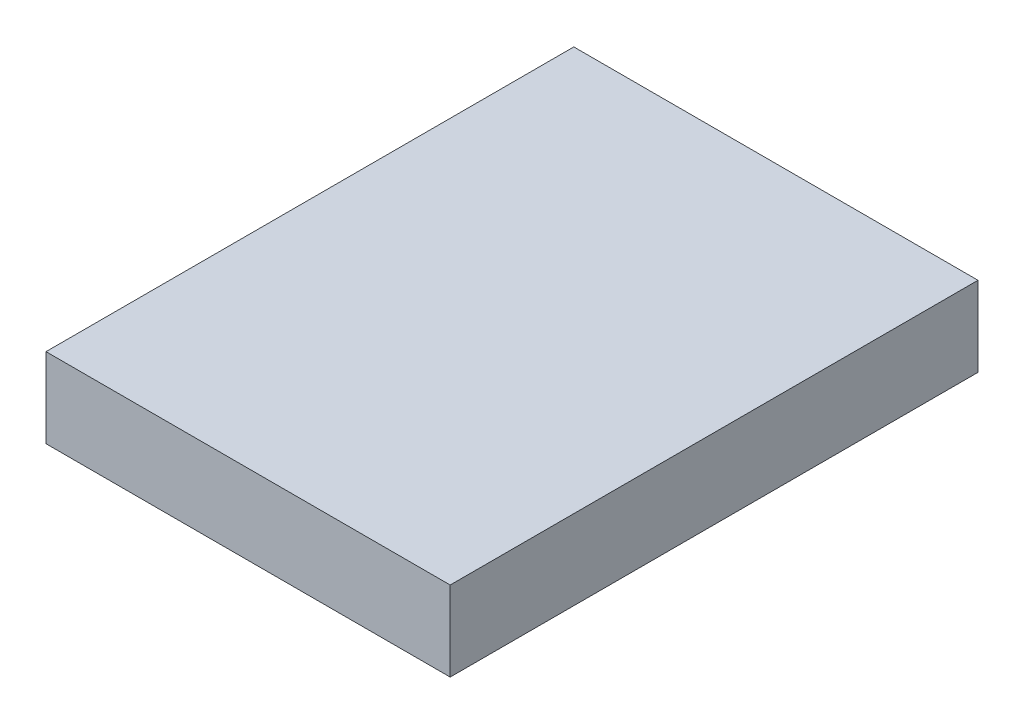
ISO-10303-21;
HEADER;
FILE_DESCRIPTION(('STEP AP214'),'2;1');
FILE_NAME('part.step','',(''),(''),'','','');
FILE_SCHEMA(('AUTOMOTIVE_DESIGN { 1 0 10303 214 1 1 1 1 }'));
ENDSEC;
DATA;
#1=APPLICATION_CONTEXT('core data for automotive mechanical design processes');
#2=APPLICATION_PROTOCOL_DEFINITION('international standard','automotive_design',2000,#1);
#3=PRODUCT_CONTEXT('',#1,'mechanical');
#4=PRODUCT('Part','Part','',(#3));
#5=PRODUCT_RELATED_PRODUCT_CATEGORY('part','',(#4));
#6=PRODUCT_DEFINITION_FORMATION('','',#4);
#7=PRODUCT_DEFINITION_CONTEXT('part definition',#1,'design');
#8=PRODUCT_DEFINITION('design','',#6,#7);
#9=PRODUCT_DEFINITION_SHAPE('','',#8);
#10=(LENGTH_UNIT() NAMED_UNIT(*) SI_UNIT(.MILLI.,.METRE.));
#11=(NAMED_UNIT(*) PLANE_ANGLE_UNIT() SI_UNIT($,.RADIAN.));
#12=(NAMED_UNIT(*) SI_UNIT($,.STERADIAN.) SOLID_ANGLE_UNIT());
#13=UNCERTAINTY_MEASURE_WITH_UNIT(LENGTH_MEASURE(1.E-05),#10,'distance_accuracy_value','');
#14=(GEOMETRIC_REPRESENTATION_CONTEXT(3) GLOBAL_UNCERTAINTY_ASSIGNED_CONTEXT((#13)) GLOBAL_UNIT_ASSIGNED_CONTEXT((#10,
#11,#12)) REPRESENTATION_CONTEXT('',''));
#15=CARTESIAN_POINT('',(0.,0.,0.));
#16=DIRECTION('',(0.,0.,1.));
#17=DIRECTION('',(1.,0.,0.));
#18=AXIS2_PLACEMENT_3D('',#15,#16,#17);
#19=CARTESIAN_POINT('',(-50.6824454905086,20.,66.1847496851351));
#20=DIRECTION('',(1.,0.,0.));
#21=DIRECTION('',(0.,0.,-1.));
#22=AXIS2_PLACEMENT_3D('',#19,#20,#21);
#23=PLANE('',#22);
#24=DIRECTION('',(0.,0.,1.));
#25=VECTOR('',#24,1.);
#26=CARTESIAN_POINT('',(-50.6824454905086,0.,66.1847496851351));
#27=LINE('',#26,#25);
#28=CARTESIAN_POINT('',(-50.6824454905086,0.,-66.1847496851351));
#29=VERTEX_POINT('',#28);
#30=CARTESIAN_POINT('',(-50.6824454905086,0.,66.1847496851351));
#31=VERTEX_POINT('',#30);
#32=EDGE_CURVE('E76',#29,#31,#27,.T.);
#33=ORIENTED_EDGE('',*,*,#32,.T.);
#34=DIRECTION('',(0.,-1.,0.));
#35=VECTOR('',#34,1.);
#36=CARTESIAN_POINT('',(-50.6824454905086,20.,66.1847496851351));
#37=LINE('',#36,#35);
#38=CARTESIAN_POINT('',(-50.6824454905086,20.,66.1847496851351));
#39=VERTEX_POINT('',#38);
#40=EDGE_CURVE('E11',#39,#31,#37,.T.);
#41=ORIENTED_EDGE('',*,*,#40,.F.);
#42=DIRECTION('',(0.,0.,1.));
#43=VECTOR('',#42,1.);
#44=CARTESIAN_POINT('',(-50.6824454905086,20.,66.1847496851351));
#45=LINE('',#44,#43);
#46=CARTESIAN_POINT('',(-50.6824454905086,20.,-66.1847496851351));
#47=VERTEX_POINT('',#46);
#48=EDGE_CURVE('E94',#47,#39,#45,.T.);
#49=ORIENTED_EDGE('',*,*,#48,.F.);
#50=DIRECTION('',(0.,-1.,0.));
#51=VECTOR('',#50,1.);
#52=CARTESIAN_POINT('',(-50.6824454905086,20.,-66.1847496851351));
#53=LINE('',#52,#51);
#54=EDGE_CURVE('E88',#47,#29,#53,.T.);
#55=ORIENTED_EDGE('',*,*,#54,.T.);
#56=EDGE_LOOP('',(#33,#41,#49,#55));
#57=FACE_BOUND('',#56,.T.);
#58=ADVANCED_FACE('F32',(#57),#23,.F.);
#59=CARTESIAN_POINT('',(-50.6824454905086,20.,66.1847496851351));
#60=DIRECTION('',(0.,0.,-1.));
#61=DIRECTION('',(-1.,0.,0.));
#62=AXIS2_PLACEMENT_3D('',#59,#60,#61);
#63=PLANE('',#62);
#64=DIRECTION('',(1.,0.,0.));
#65=VECTOR('',#64,1.);
#66=CARTESIAN_POINT('',(-50.6824454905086,0.,66.1847496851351));
#67=LINE('',#66,#65);
#68=CARTESIAN_POINT('',(50.6824454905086,0.,66.1847496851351));
#69=VERTEX_POINT('',#68);
#70=EDGE_CURVE('E72',#31,#69,#67,.T.);
#71=ORIENTED_EDGE('',*,*,#70,.T.);
#72=DIRECTION('',(0.,-1.,0.));
#73=VECTOR('',#72,1.);
#74=CARTESIAN_POINT('',(50.6824454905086,20.,66.1847496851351));
#75=LINE('',#74,#73);
#76=CARTESIAN_POINT('',(50.6824454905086,20.,66.1847496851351));
#77=VERTEX_POINT('',#76);
#78=EDGE_CURVE('E39',#77,#69,#75,.T.);
#79=ORIENTED_EDGE('',*,*,#78,.F.);
#80=DIRECTION('',(1.,0.,0.));
#81=VECTOR('',#80,1.);
#82=CARTESIAN_POINT('',(-50.6824454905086,20.,66.1847496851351));
#83=LINE('',#82,#81);
#84=EDGE_CURVE('E84',#39,#77,#83,.T.);
#85=ORIENTED_EDGE('',*,*,#84,.F.);
#86=ORIENTED_EDGE('',*,*,#40,.T.);
#87=EDGE_LOOP('',(#71,#79,#85,#86));
#88=FACE_BOUND('',#87,.T.);
#89=ADVANCED_FACE('F83',(#88),#63,.F.);
#90=CARTESIAN_POINT('',(50.6824454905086,20.,66.1847496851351));
#91=DIRECTION('',(-1.,0.,0.));
#92=DIRECTION('',(0.,0.,1.));
#93=AXIS2_PLACEMENT_3D('',#90,#91,#92);
#94=PLANE('',#93);
#95=DIRECTION('',(0.,0.,-1.));
#96=VECTOR('',#95,1.);
#97=CARTESIAN_POINT('',(50.6824454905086,0.,66.1847496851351));
#98=LINE('',#97,#96);
#99=CARTESIAN_POINT('',(50.6824454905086,0.,-66.1847496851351));
#100=VERTEX_POINT('',#99);
#101=EDGE_CURVE('E77',#69,#100,#98,.T.);
#102=ORIENTED_EDGE('',*,*,#101,.T.);
#103=DIRECTION('',(0.,-1.,0.));
#104=VECTOR('',#103,1.);
#105=CARTESIAN_POINT('',(50.6824454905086,20.,-66.1847496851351));
#106=LINE('',#105,#104);
#107=CARTESIAN_POINT('',(50.6824454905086,20.,-66.1847496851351));
#108=VERTEX_POINT('',#107);
#109=EDGE_CURVE('E100',#108,#100,#106,.T.);
#110=ORIENTED_EDGE('',*,*,#109,.F.);
#111=DIRECTION('',(0.,0.,-1.));
#112=VECTOR('',#111,1.);
#113=CARTESIAN_POINT('',(50.6824454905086,20.,66.1847496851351));
#114=LINE('',#113,#112);
#115=EDGE_CURVE('E51',#77,#108,#114,.T.);
#116=ORIENTED_EDGE('',*,*,#115,.F.);
#117=ORIENTED_EDGE('',*,*,#78,.T.);
#118=EDGE_LOOP('',(#102,#110,#116,#117));
#119=FACE_BOUND('',#118,.T.);
#120=ADVANCED_FACE('F103',(#119),#94,.F.);
#121=CARTESIAN_POINT('',(-50.6824454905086,20.,-66.1847496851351));
#122=DIRECTION('',(0.,0.,1.));
#123=DIRECTION('',(1.,0.,0.));
#124=AXIS2_PLACEMENT_3D('',#121,#122,#123);
#125=PLANE('',#124);
#126=DIRECTION('',(-1.,0.,0.));
#127=VECTOR('',#126,1.);
#128=CARTESIAN_POINT('',(-50.6824454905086,0.,-66.1847496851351));
#129=LINE('',#128,#127);
#130=EDGE_CURVE('E92',#100,#29,#129,.T.);
#131=ORIENTED_EDGE('',*,*,#130,.T.);
#132=ORIENTED_EDGE('',*,*,#54,.F.);
#133=DIRECTION('',(-1.,0.,0.));
#134=VECTOR('',#133,1.);
#135=CARTESIAN_POINT('',(-50.6824454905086,20.,-66.1847496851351));
#136=LINE('',#135,#134);
#137=EDGE_CURVE('E46',#108,#47,#136,.T.);
#138=ORIENTED_EDGE('',*,*,#137,.F.);
#139=ORIENTED_EDGE('',*,*,#109,.T.);
#140=EDGE_LOOP('',(#131,#132,#138,#139));
#141=FACE_BOUND('',#140,.T.);
#142=ADVANCED_FACE('F105',(#141),#125,.F.);
#143=CARTESIAN_POINT('',(-50.6824454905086,20.,-66.1847496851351));
#144=DIRECTION('',(0.,-1.,0.));
#145=DIRECTION('',(0.,0.,-1.));
#146=AXIS2_PLACEMENT_3D('',#143,#144,#145);
#147=PLANE('',#146);
#148=ORIENTED_EDGE('',*,*,#48,.T.);
#149=ORIENTED_EDGE('',*,*,#84,.T.);
#150=ORIENTED_EDGE('',*,*,#115,.T.);
#151=ORIENTED_EDGE('',*,*,#137,.T.);
#152=EDGE_LOOP('',(#148,#149,#150,#151));
#153=FACE_BOUND('',#152,.T.);
#154=ADVANCED_FACE('F106',(#153),#147,.F.);
#155=CARTESIAN_POINT('',(-50.6824454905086,0.,-66.1847496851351));
#156=DIRECTION('',(0.,-1.,0.));
#157=DIRECTION('',(0.,0.,-1.));
#158=AXIS2_PLACEMENT_3D('',#155,#156,#157);
#159=PLANE('',#158);
#160=ORIENTED_EDGE('',*,*,#32,.F.);
#161=ORIENTED_EDGE('',*,*,#130,.F.);
#162=ORIENTED_EDGE('',*,*,#101,.F.);
#163=ORIENTED_EDGE('',*,*,#70,.F.);
#164=EDGE_LOOP('',(#160,#161,#162,#163));
#165=FACE_BOUND('',#164,.T.);
#166=ADVANCED_FACE('F73',(#165),#159,.T.);
#167=CLOSED_SHELL('',(#58,#89,#120,#142,#154,#166));
#168=MANIFOLD_SOLID_BREP('B2',#167);
#169=ADVANCED_BREP_SHAPE_REPRESENTATION('',(#18,#168),#14);
#170=SHAPE_DEFINITION_REPRESENTATION(#9,#169);
ENDSEC;
END-ISO-10303-21;
